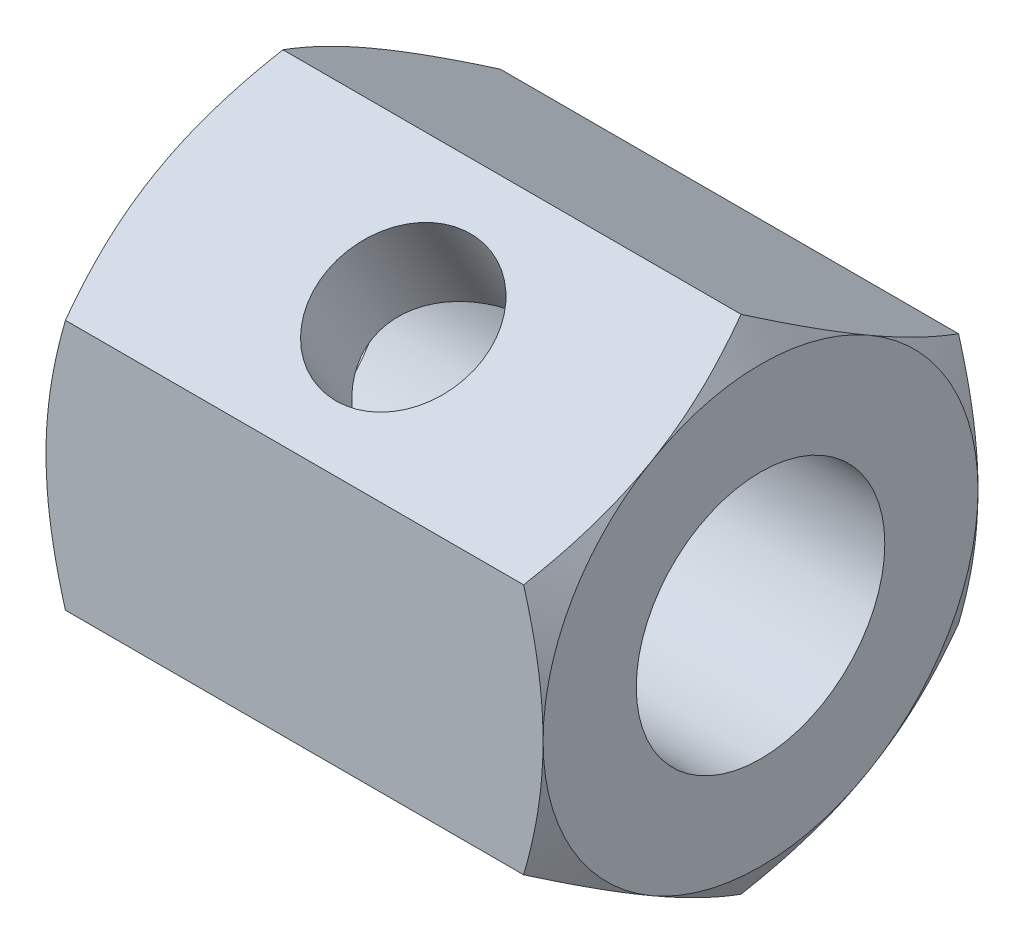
ISO-10303-21;
HEADER;
FILE_DESCRIPTION(('STEP AP214'),'2;1');
FILE_NAME('part.step','',(''),(''),'','','');
FILE_SCHEMA(('AUTOMOTIVE_DESIGN { 1 0 10303 214 1 1 1 1 }'));
ENDSEC;
DATA;
#1=APPLICATION_CONTEXT('core data for automotive mechanical design processes');
#2=APPLICATION_PROTOCOL_DEFINITION('international standard','automotive_design',2000,#1);
#3=PRODUCT_CONTEXT('',#1,'mechanical');
#4=PRODUCT('Part','Part','',(#3));
#5=PRODUCT_RELATED_PRODUCT_CATEGORY('part','',(#4));
#6=PRODUCT_DEFINITION_FORMATION('','',#4);
#7=PRODUCT_DEFINITION_CONTEXT('part definition',#1,'design');
#8=PRODUCT_DEFINITION('design','',#6,#7);
#9=PRODUCT_DEFINITION_SHAPE('','',#8);
#10=(LENGTH_UNIT() NAMED_UNIT(*) SI_UNIT(.MILLI.,.METRE.));
#11=(NAMED_UNIT(*) PLANE_ANGLE_UNIT() SI_UNIT($,.RADIAN.));
#12=(NAMED_UNIT(*) SI_UNIT($,.STERADIAN.) SOLID_ANGLE_UNIT());
#13=UNCERTAINTY_MEASURE_WITH_UNIT(LENGTH_MEASURE(1.E-05),#10,'distance_accuracy_value','');
#14=(GEOMETRIC_REPRESENTATION_CONTEXT(3) GLOBAL_UNCERTAINTY_ASSIGNED_CONTEXT((#13)) GLOBAL_UNIT_ASSIGNED_CONTEXT((#10,
#11,#12)) REPRESENTATION_CONTEXT('',''));
#15=CARTESIAN_POINT('',(0.,0.,0.));
#16=DIRECTION('',(0.,0.,1.));
#17=DIRECTION('',(1.,0.,0.));
#18=AXIS2_PLACEMENT_3D('',#15,#16,#17);
#19=CARTESIAN_POINT('',(4.,4.04145188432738,0.));
#20=DIRECTION('',(0.,-0.866025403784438,-0.500000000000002));
#21=DIRECTION('',(0.,0.500000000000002,-0.866025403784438));
#22=AXIS2_PLACEMENT_3D('',#19,#20,#21);
#23=PLANE('',#22);
#24=DIRECTION('',(-1.,0.,0.));
#25=VECTOR('',#24,1.);
#26=CARTESIAN_POINT('',(4.,4.04145188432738,0.));
#27=LINE('',#26,#25);
#28=CARTESIAN_POINT('',(3.68739260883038,4.04145188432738,0.));
#29=VERTEX_POINT('',#28);
#30=CARTESIAN_POINT('',(-3.68739260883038,4.04145188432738,0.));
#31=VERTEX_POINT('',#30);
#32=EDGE_CURVE('E261',#29,#31,#27,.T.);
#33=ORIENTED_EDGE('',*,*,#32,.T.);
#34=CARTESIAN_POINT('',(-3.68732593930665,4.04156735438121,-0.000199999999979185));
#35=CARTESIAN_POINT('',(-3.73861421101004,3.9527667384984,0.15360717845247));
#36=CARTESIAN_POINT('',(-3.78525904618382,3.86319960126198,0.308742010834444));
#37=CARTESIAN_POINT('',(-3.86667812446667,3.68251437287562,0.621698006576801));
#38=CARTESIAN_POINT('',(-3.90142356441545,3.59139307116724,0.779524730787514));
#39=CARTESIAN_POINT('',(-3.95550997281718,3.41027974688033,1.09322221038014));
#40=CARTESIAN_POINT('',(-3.97521091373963,3.32031559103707,1.24904469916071));
#41=CARTESIAN_POINT('',(-3.99872986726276,3.13996396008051,1.56142288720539));
#42=CARTESIAN_POINT('',(-4.00256735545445,3.04957714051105,1.71797745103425));
#43=CARTESIAN_POINT('',(-3.99458469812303,2.88068384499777,2.01050921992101));
#44=CARTESIAN_POINT('',(-3.9847245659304,2.80215208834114,2.14653021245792));
#45=CARTESIAN_POINT('',(-3.95347353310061,2.64560020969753,2.41768602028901));
#46=CARTESIAN_POINT('',(-3.93207195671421,2.56758062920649,2.5528198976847));
#47=CARTESIAN_POINT('',(-3.87856959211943,2.41070596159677,2.8245347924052));
#48=CARTESIAN_POINT('',(-3.84624200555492,2.33187072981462,2.96108141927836));
#49=CARTESIAN_POINT('',(-3.77287106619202,2.17537608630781,3.23213809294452));
#50=CARTESIAN_POINT('',(-3.73184495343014,2.09771466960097,3.36665161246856));
#51=CARTESIAN_POINT('',(-3.68732593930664,2.02061047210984,3.50020000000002));
#52=B_SPLINE_CURVE_WITH_KNOTS('',3,(#34,#35,#36,#37,#38,#39,#40,#41,#42,#43,#44,#45,#46,#47,#48,
#49,#50,#51),.UNSPECIFIED.,.F.,.F.,(4,2,2,2,2,2,2,2,4),(0.,0.554793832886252,1.11092123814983,
1.65328467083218,2.19498204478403,2.6666513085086,3.13875761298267,3.6213361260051,
4.10296698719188),.UNSPECIFIED.);
#53=CARTESIAN_POINT('',(-4.,3.03108891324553,1.75000000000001));
#54=VERTEX_POINT('',#53);
#55=EDGE_CURVE('E211',#31,#54,#52,.T.);
#56=ORIENTED_EDGE('',*,*,#55,.T.);
#57=CARTESIAN_POINT('',(-3.68739260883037,2.02072594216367,3.50000000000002));
#58=VERTEX_POINT('',#57);
#59=EDGE_CURVE('E131',#54,#58,#52,.T.);
#60=ORIENTED_EDGE('',*,*,#59,.T.);
#61=DIRECTION('',(-1.,0.,0.));
#62=VECTOR('',#61,1.);
#63=CARTESIAN_POINT('',(4.,2.02072594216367,3.50000000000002));
#64=LINE('',#63,#62);
#65=CARTESIAN_POINT('',(3.68739260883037,2.02072594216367,3.50000000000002));
#66=VERTEX_POINT('',#65);
#67=EDGE_CURVE('E155',#66,#58,#64,.T.);
#68=ORIENTED_EDGE('',*,*,#67,.F.);
#69=CARTESIAN_POINT('',(3.68732593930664,2.02061047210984,3.50020000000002));
#70=CARTESIAN_POINT('',(3.73861421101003,2.10941108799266,3.34639282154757));
#71=CARTESIAN_POINT('',(3.78525904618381,2.19897822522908,3.1912579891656));
#72=CARTESIAN_POINT('',(3.86667812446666,2.37966345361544,2.87830199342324));
#73=CARTESIAN_POINT('',(3.90142356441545,2.47078475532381,2.72047526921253));
#74=CARTESIAN_POINT('',(3.95550997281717,2.65189807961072,2.4067777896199));
#75=CARTESIAN_POINT('',(3.97521091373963,2.74186223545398,2.25095530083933));
#76=CARTESIAN_POINT('',(3.99872986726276,2.92221386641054,1.93857711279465));
#77=CARTESIAN_POINT('',(4.00256735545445,3.01260068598,1.78202254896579));
#78=CARTESIAN_POINT('',(3.99458469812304,3.18149398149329,1.48949078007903));
#79=CARTESIAN_POINT('',(3.98472456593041,3.26002573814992,1.35346978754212));
#80=CARTESIAN_POINT('',(3.95347353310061,3.41657761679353,1.08231397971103));
#81=CARTESIAN_POINT('',(3.93207195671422,3.49459719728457,0.94718010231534));
#82=CARTESIAN_POINT('',(3.87856959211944,3.65147186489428,0.675465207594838));
#83=CARTESIAN_POINT('',(3.84624200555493,3.73030709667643,0.538918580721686));
#84=CARTESIAN_POINT('',(3.77287106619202,3.88680174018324,0.267861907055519));
#85=CARTESIAN_POINT('',(3.73184495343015,3.96446315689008,0.133348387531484));
#86=CARTESIAN_POINT('',(3.68732593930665,4.04156735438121,-0.000199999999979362));
#87=B_SPLINE_CURVE_WITH_KNOTS('',3,(#69,#70,#71,#72,#73,#74,#75,#76,#77,#78,#79,#80,#81,#82,#83,
#84,#85,#86),.UNSPECIFIED.,.F.,.F.,(4,2,2,2,2,2,2,2,4),(0.,0.554793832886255,1.11092123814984,
1.65328467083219,2.19498204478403,2.6666513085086,3.13875761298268,3.6213361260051,
4.10296698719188),.UNSPECIFIED.);
#88=CARTESIAN_POINT('',(4.,3.03108891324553,1.75000000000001));
#89=VERTEX_POINT('',#88);
#90=EDGE_CURVE('E231',#66,#89,#87,.T.);
#91=ORIENTED_EDGE('',*,*,#90,.T.);
#92=EDGE_CURVE('E224',#89,#29,#87,.T.);
#93=ORIENTED_EDGE('',*,*,#92,.T.);
#94=EDGE_LOOP('',(#33,#56,#60,#68,#91,#93));
#95=FACE_BOUND('',#94,.T.);
#96=CARTESIAN_POINT('',(0.,3.03108891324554,1.75000000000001));
#97=DIRECTION('',(0.,0.866025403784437,0.500000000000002));
#98=DIRECTION('',(0.,-0.500000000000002,0.866025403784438));
#99=AXIS2_PLACEMENT_3D('',#96,#97,#98);
#100=CIRCLE('',#99,1.24999999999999);
#101=CARTESIAN_POINT('',(0.,2.40608891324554,2.83253175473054));
#102=VERTEX_POINT('',#101);
#103=EDGE_CURVE('E164',#102,#102,#100,.T.);
#104=ORIENTED_EDGE('',*,*,#103,.F.);
#105=EDGE_LOOP('',(#104));
#106=FACE_BOUND('',#105,.T.);
#107=ADVANCED_FACE('F31',(#95,#106),#23,.F.);
#108=CARTESIAN_POINT('',(4.,4.04145188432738,0.));
#109=DIRECTION('',(1.,0.,0.));
#110=DIRECTION('',(0.,0.,-1.));
#111=AXIS2_PLACEMENT_3D('',#108,#109,#110);
#112=PLANE('',#111);
#113=CARTESIAN_POINT('',(4.,0.,0.));
#114=DIRECTION('',(-1.,0.,0.));
#115=DIRECTION('',(0.,0.,1.));
#116=AXIS2_PLACEMENT_3D('',#113,#114,#115);
#117=CIRCLE('',#116,3.50000000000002);
#118=CARTESIAN_POINT('',(4.,0.,-3.49999999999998));
#119=VERTEX_POINT('',#118);
#120=CARTESIAN_POINT('',(4.,-3.03108891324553,-1.74999999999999));
#121=VERTEX_POINT('',#120);
#122=EDGE_CURVE('E348',#119,#121,#117,.T.);
#123=ORIENTED_EDGE('',*,*,#122,.F.);
#124=CARTESIAN_POINT('',(4.,3.03108891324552,-1.75));
#125=VERTEX_POINT('',#124);
#126=EDGE_CURVE('E345',#125,#119,#117,.T.);
#127=ORIENTED_EDGE('',*,*,#126,.F.);
#128=EDGE_CURVE('E337',#89,#125,#117,.T.);
#129=ORIENTED_EDGE('',*,*,#128,.F.);
#130=CARTESIAN_POINT('',(4.,0.,3.50000000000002));
#131=VERTEX_POINT('',#130);
#132=EDGE_CURVE('E331',#131,#89,#117,.T.);
#133=ORIENTED_EDGE('',*,*,#132,.F.);
#134=CARTESIAN_POINT('',(4.,-3.03108891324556,1.75000000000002));
#135=VERTEX_POINT('',#134);
#136=EDGE_CURVE('E334',#135,#131,#117,.T.);
#137=ORIENTED_EDGE('',*,*,#136,.F.);
#138=EDGE_CURVE('E346',#121,#135,#117,.T.);
#139=ORIENTED_EDGE('',*,*,#138,.F.);
#140=EDGE_LOOP('',(#123,#127,#129,#133,#137,#139));
#141=FACE_BOUND('',#140,.T.);
#142=CARTESIAN_POINT('',(4.,0.,0.));
#143=DIRECTION('',(1.,0.,0.));
#144=DIRECTION('',(0.,0.,-1.));
#145=AXIS2_PLACEMENT_3D('',#142,#143,#144);
#146=CIRCLE('',#145,2.);
#147=CARTESIAN_POINT('',(4.,0.,-2.));
#148=VERTEX_POINT('',#147);
#149=EDGE_CURVE('E244',#148,#148,#146,.T.);
#150=ORIENTED_EDGE('',*,*,#149,.F.);
#151=EDGE_LOOP('',(#150));
#152=FACE_BOUND('',#151,.T.);
#153=ADVANCED_FACE('F219',(#141,#152),#112,.T.);
#154=CARTESIAN_POINT('',(-4.,4.04145188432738,0.));
#155=DIRECTION('',(1.,0.,0.));
#156=DIRECTION('',(0.,0.,-1.));
#157=AXIS2_PLACEMENT_3D('',#154,#155,#156);
#158=PLANE('',#157);
#159=CARTESIAN_POINT('',(-4.,0.,0.));
#160=DIRECTION('',(-1.,0.,0.));
#161=DIRECTION('',(0.,0.,1.));
#162=AXIS2_PLACEMENT_3D('',#159,#160,#161);
#163=CIRCLE('',#162,3.50000000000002);
#164=CARTESIAN_POINT('',(-4.,3.03108891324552,-1.75));
#165=VERTEX_POINT('',#164);
#166=CARTESIAN_POINT('',(-4.,0.,-3.49999999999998));
#167=VERTEX_POINT('',#166);
#168=EDGE_CURVE('E52',#165,#167,#163,.T.);
#169=ORIENTED_EDGE('',*,*,#168,.T.);
#170=CARTESIAN_POINT('',(-4.,-3.03108891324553,-1.74999999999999));
#171=VERTEX_POINT('',#170);
#172=EDGE_CURVE('E162',#167,#171,#163,.T.);
#173=ORIENTED_EDGE('',*,*,#172,.T.);
#174=CARTESIAN_POINT('',(-4.,-3.03108891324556,1.75000000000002));
#175=VERTEX_POINT('',#174);
#176=EDGE_CURVE('E160',#171,#175,#163,.T.);
#177=ORIENTED_EDGE('',*,*,#176,.T.);
#178=CARTESIAN_POINT('',(-4.,0.,3.50000000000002));
#179=VERTEX_POINT('',#178);
#180=EDGE_CURVE('E139',#175,#179,#163,.T.);
#181=ORIENTED_EDGE('',*,*,#180,.T.);
#182=EDGE_CURVE('E125',#179,#54,#163,.T.);
#183=ORIENTED_EDGE('',*,*,#182,.T.);
#184=EDGE_CURVE('E137',#54,#165,#163,.T.);
#185=ORIENTED_EDGE('',*,*,#184,.T.);
#186=EDGE_LOOP('',(#169,#173,#177,#181,#183,#185));
#187=FACE_BOUND('',#186,.T.);
#188=CARTESIAN_POINT('',(-4.,0.,0.));
#189=DIRECTION('',(1.,0.,0.));
#190=DIRECTION('',(0.,0.,-1.));
#191=AXIS2_PLACEMENT_3D('',#188,#189,#190);
#192=CIRCLE('',#191,2.);
#193=CARTESIAN_POINT('',(-4.,0.,-2.));
#194=VERTEX_POINT('',#193);
#195=EDGE_CURVE('E248',#194,#194,#192,.T.);
#196=ORIENTED_EDGE('',*,*,#195,.T.);
#197=EDGE_LOOP('',(#196));
#198=FACE_BOUND('',#197,.T.);
#199=ADVANCED_FACE('F157',(#187,#198),#158,.F.);
#200=CARTESIAN_POINT('',(4.,2.02072594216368,-3.49999999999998));
#201=DIRECTION('',(0.,-0.866025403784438,0.500000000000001));
#202=DIRECTION('',(0.,-0.500000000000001,-0.866025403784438));
#203=AXIS2_PLACEMENT_3D('',#200,#201,#202);
#204=PLANE('',#203);
#205=DIRECTION('',(-1.,0.,0.));
#206=VECTOR('',#205,1.);
#207=CARTESIAN_POINT('',(4.,2.02072594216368,-3.49999999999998));
#208=LINE('',#207,#206);
#209=CARTESIAN_POINT('',(3.68739260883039,2.02072594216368,-3.49999999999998));
#210=VERTEX_POINT('',#209);
#211=CARTESIAN_POINT('',(-3.68739260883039,2.02072594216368,-3.49999999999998));
#212=VERTEX_POINT('',#211);
#213=EDGE_CURVE('E247',#210,#212,#208,.T.);
#214=ORIENTED_EDGE('',*,*,#213,.T.);
#215=CARTESIAN_POINT('',(-3.68732593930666,2.02061047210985,-3.50019999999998));
#216=CARTESIAN_POINT('',(-3.73861421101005,2.10941108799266,-3.34639282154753));
#217=CARTESIAN_POINT('',(-3.78525904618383,2.19897822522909,-3.19125798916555));
#218=CARTESIAN_POINT('',(-3.86667812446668,2.37966345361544,-2.8783019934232));
#219=CARTESIAN_POINT('',(-3.90142356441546,2.47078475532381,-2.72047526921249));
#220=CARTESIAN_POINT('',(-3.95550997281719,2.65189807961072,-2.40677778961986));
#221=CARTESIAN_POINT('',(-3.97521091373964,2.74186223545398,-2.25095530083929));
#222=CARTESIAN_POINT('',(-3.99872986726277,2.92221386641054,-1.93857711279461));
#223=CARTESIAN_POINT('',(-4.00256735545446,3.01260068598,-1.78202254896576));
#224=CARTESIAN_POINT('',(-3.99458469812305,3.18149398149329,-1.489490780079));
#225=CARTESIAN_POINT('',(-3.98472456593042,3.26002573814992,-1.35346978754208));
#226=CARTESIAN_POINT('',(-3.95347353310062,3.41657761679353,-1.08231397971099));
#227=CARTESIAN_POINT('',(-3.93207195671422,3.49459719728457,-0.947180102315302));
#228=CARTESIAN_POINT('',(-3.87856959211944,3.65147186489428,-0.6754652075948));
#229=CARTESIAN_POINT('',(-3.84624200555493,3.73030709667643,-0.538918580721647));
#230=CARTESIAN_POINT('',(-3.77287106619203,3.88680174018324,-0.267861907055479));
#231=CARTESIAN_POINT('',(-3.73184495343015,3.96446315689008,-0.133348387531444));
#232=CARTESIAN_POINT('',(-3.68732593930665,4.04156735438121,0.000200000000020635));
#233=B_SPLINE_CURVE_WITH_KNOTS('',3,(#215,#216,#217,#218,#219,#220,#221,#222,#223,#224,#225,
#226,#227,#228,#229,#230,#231,#232),.UNSPECIFIED.,.F.,.F.,(4,2,2,2,2,2,2,2,4),(0.,
0.554793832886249,1.11092123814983,1.65328467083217,2.19498204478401,2.66665130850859,
3.13875761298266,3.62133612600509,4.10296698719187),.UNSPECIFIED.);
#234=EDGE_CURVE('E347',#212,#165,#233,.T.);
#235=ORIENTED_EDGE('',*,*,#234,.T.);
#236=EDGE_CURVE('E212',#165,#31,#233,.T.);
#237=ORIENTED_EDGE('',*,*,#236,.T.);
#238=ORIENTED_EDGE('',*,*,#32,.F.);
#239=CARTESIAN_POINT('',(3.68732593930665,4.04156735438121,0.000200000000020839));
#240=CARTESIAN_POINT('',(3.73861421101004,3.9527667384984,-0.153607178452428));
#241=CARTESIAN_POINT('',(3.78525904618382,3.86319960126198,-0.308742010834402));
#242=CARTESIAN_POINT('',(3.86667812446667,3.68251437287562,-0.621698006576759));
#243=CARTESIAN_POINT('',(3.90142356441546,3.59139307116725,-0.779524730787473));
#244=CARTESIAN_POINT('',(3.95550997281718,3.41027974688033,-1.0932222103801));
#245=CARTESIAN_POINT('',(3.97521091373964,3.32031559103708,-1.24904469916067));
#246=CARTESIAN_POINT('',(3.99872986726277,3.13996396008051,-1.56142288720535));
#247=CARTESIAN_POINT('',(4.00256735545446,3.04957714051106,-1.71797745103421));
#248=CARTESIAN_POINT('',(3.99458469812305,2.88068384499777,-2.01050921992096));
#249=CARTESIAN_POINT('',(3.98472456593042,2.80215208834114,-2.14653021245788));
#250=CARTESIAN_POINT('',(3.95347353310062,2.64560020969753,-2.41768602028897));
#251=CARTESIAN_POINT('',(3.93207195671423,2.56758062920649,-2.55281989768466));
#252=CARTESIAN_POINT('',(3.87856959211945,2.41070596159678,-2.82453479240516));
#253=CARTESIAN_POINT('',(3.84624200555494,2.33187072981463,-2.96108141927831));
#254=CARTESIAN_POINT('',(3.77287106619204,2.17537608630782,-3.23213809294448));
#255=CARTESIAN_POINT('',(3.73184495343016,2.09771466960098,-3.36665161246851));
#256=CARTESIAN_POINT('',(3.68732593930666,2.02061047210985,-3.50019999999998));
#257=B_SPLINE_CURVE_WITH_KNOTS('',3,(#239,#240,#241,#242,#243,#244,#245,#246,#247,#248,#249,
#250,#251,#252,#253,#254,#255,#256),.UNSPECIFIED.,.F.,.F.,(4,2,2,2,2,2,2,2,4),(0.,
0.554793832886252,1.11092123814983,1.65328467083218,2.19498204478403,2.66665130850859,
3.13875761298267,3.62133612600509,4.10296698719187),.UNSPECIFIED.);
#258=EDGE_CURVE('E353',#29,#125,#257,.T.);
#259=ORIENTED_EDGE('',*,*,#258,.T.);
#260=EDGE_CURVE('E342',#125,#210,#257,.T.);
#261=ORIENTED_EDGE('',*,*,#260,.T.);
#262=EDGE_LOOP('',(#214,#235,#237,#238,#259,#261));
#263=FACE_BOUND('',#262,.T.);
#264=ADVANCED_FACE('F33',(#263),#204,.F.);
#265=CARTESIAN_POINT('',(4.,2.02072594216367,3.50000000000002));
#266=DIRECTION('',(0.,0.,-1.));
#267=DIRECTION('',(-1.,0.,0.));
#268=AXIS2_PLACEMENT_3D('',#265,#266,#267);
#269=PLANE('',#268);
#270=ORIENTED_EDGE('',*,*,#67,.T.);
#271=CARTESIAN_POINT('',(-2.24823911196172,-5.517696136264,3.50000000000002));
#272=CARTESIAN_POINT('',(-2.3231358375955,-5.3640335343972,3.50000000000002));
#273=CARTESIAN_POINT('',(-2.39733986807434,-5.21002764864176,3.50000000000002));
#274=CARTESIAN_POINT('',(-2.54397460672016,-4.90114704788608,3.50000000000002));
#275=CARTESIAN_POINT('',(-2.61640505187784,-4.74627220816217,3.50000000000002));
#276=CARTESIAN_POINT('',(-2.7594500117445,-4.43471591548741,3.50000000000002));
#277=CARTESIAN_POINT('',(-2.83005324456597,-4.27802926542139,3.50000000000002));
#278=CARTESIAN_POINT('',(-2.96848733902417,-3.96344053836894,3.50000000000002));
#279=CARTESIAN_POINT('',(-3.03631832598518,-3.80553851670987,3.50000000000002));
#280=CARTESIAN_POINT('',(-3.17072464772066,-3.48287670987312,3.50000000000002));
#281=CARTESIAN_POINT('',(-3.23717895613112,-3.31806624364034,3.50000000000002));
#282=CARTESIAN_POINT('',(-3.36527197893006,-2.9865506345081,3.50000000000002));
#283=CARTESIAN_POINT('',(-3.42691016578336,-2.81984528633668,3.50000000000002));
#284=CARTESIAN_POINT('',(-3.54381855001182,-2.48455858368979,3.50000000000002));
#285=CARTESIAN_POINT('',(-3.5991008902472,-2.31598150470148,3.50000000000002));
#286=CARTESIAN_POINT('',(-3.70158342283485,-1.9764107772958,3.50000000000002));
#287=CARTESIAN_POINT('',(-3.74878606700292,-1.80541787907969,3.50000000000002));
#288=CARTESIAN_POINT('',(-3.83265303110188,-1.46186590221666,3.50000000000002));
#289=CARTESIAN_POINT('',(-3.86937653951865,-1.28932153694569,3.50000000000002));
#290=CARTESIAN_POINT('',(-3.93026837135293,-0.941996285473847,3.50000000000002));
#291=CARTESIAN_POINT('',(-3.95443806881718,-0.767215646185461,3.50000000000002));
#292=CARTESIAN_POINT('',(-3.98798243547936,-0.418609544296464,3.50000000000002));
#293=CARTESIAN_POINT('',(-3.99755428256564,-0.244803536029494,3.50000000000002));
#294=CARTESIAN_POINT('',(-4.00161659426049,0.103003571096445,3.50000000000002));
#295=CARTESIAN_POINT('',(-3.9961068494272,0.27700467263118,3.50000000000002));
#296=CARTESIAN_POINT('',(-3.97454594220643,0.569771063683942,3.50000000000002));
#297=CARTESIAN_POINT('',(-3.96231865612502,0.688837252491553,3.50000000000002));
#298=CARTESIAN_POINT('',(-3.9315159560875,0.926151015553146,3.50000000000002));
#299=CARTESIAN_POINT('',(-3.91293975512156,1.04439848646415,3.50000000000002));
#300=CARTESIAN_POINT('',(-3.84865875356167,1.3977224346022,3.50000000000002));
#301=CARTESIAN_POINT('',(-3.794411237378,1.63126494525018,3.50000000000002));
#302=CARTESIAN_POINT('',(-3.6996529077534,1.98067249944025,3.50000000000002));
#303=CARTESIAN_POINT('',(-3.66536401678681,2.09832851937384,3.50000000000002));
#304=CARTESIAN_POINT('',(-3.59305415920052,2.33249920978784,3.50000000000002));
#305=CARTESIAN_POINT('',(-3.5550331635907,2.4490138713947,3.50000000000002));
#306=CARTESIAN_POINT('',(-3.4758833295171,2.68093688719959,3.50000000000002));
#307=CARTESIAN_POINT('',(-3.43475535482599,2.79634553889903,3.50000000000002));
#308=CARTESIAN_POINT('',(-3.34989244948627,3.02619406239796,3.50000000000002));
#309=CARTESIAN_POINT('',(-3.30615758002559,3.14063395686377,3.50000000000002));
#310=CARTESIAN_POINT('',(-3.18443760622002,3.45024220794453,3.50000000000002));
#311=CARTESIAN_POINT('',(-3.10433839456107,3.64457866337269,3.50000000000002));
#312=CARTESIAN_POINT('',(-2.93938953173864,4.03123256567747,3.50000000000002));
#313=CARTESIAN_POINT('',(-2.85453933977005,4.22354977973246,3.50000000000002));
#314=CARTESIAN_POINT('',(-2.6812230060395,4.6066251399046,3.50000000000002));
#315=CARTESIAN_POINT('',(-2.59275558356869,4.7973827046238,3.50000000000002));
#316=CARTESIAN_POINT('',(-2.41306651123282,5.1775989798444,3.50000000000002));
#317=CARTESIAN_POINT('',(-2.32184477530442,5.3670576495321,3.50000000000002));
#318=CARTESIAN_POINT('',(-2.13710830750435,5.74522673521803,3.50000000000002));
#319=CARTESIAN_POINT('',(-2.04359014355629,5.93393547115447,3.50000000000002));
#320=CARTESIAN_POINT('',(-1.85484549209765,6.31049758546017,3.50000000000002));
#321=CARTESIAN_POINT('',(-1.75961898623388,6.49835095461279,3.50000000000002));
#322=CARTESIAN_POINT('',(-1.47194584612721,7.06078180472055,3.50000000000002));
#323=CARTESIAN_POINT('',(-1.27746262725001,7.43431711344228,3.50000000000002));
#324=CARTESIAN_POINT('',(-0.905848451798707,8.13967176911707,3.50000000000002));
#325=CARTESIAN_POINT('',(-0.729083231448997,8.47168474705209,3.50000000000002));
#326=CARTESIAN_POINT('',(-0.373429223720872,9.13459786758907,3.50000000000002));
#327=CARTESIAN_POINT('',(-0.194540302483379,9.46549793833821,3.50000000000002));
#328=CARTESIAN_POINT('',(0.164195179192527,10.1253176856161,3.50000000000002));
#329=CARTESIAN_POINT('',(0.344036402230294,10.4542402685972,3.50000000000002));
#330=CARTESIAN_POINT('',(0.704921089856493,11.1113910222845,3.50000000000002));
#331=CARTESIAN_POINT('',(0.885964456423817,11.4396192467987,3.50000000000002));
#332=CARTESIAN_POINT('',(1.06744506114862,11.7676040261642,3.50000000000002));
#333=B_SPLINE_CURVE_WITH_KNOTS('',3,(#271,#272,#273,#274,#275,#276,#277,#278,#279,#280,#281,
#282,#283,#284,#285,#286,#287,#288,#289,#290,#291,#292,#293,#294,#295,#296,#297,#298,#299,#300,
#301,#302,#303,#304,#305,#306,#307,#308,#309,#310,#311,#312,#313,#314,#315,#316,#317,#318,#319,
#320,#321,#322,#323,#324,#325,#326,#327,#328,#329,#330,#331,#332),.UNSPECIFIED.,.F.,.F.,(4,2,2,
2,2,2,2,2,2,2,2,2,2,2,2,2,2,2,2,2,2,2,2,2,2,2,2,2,2,2,4),(0.,0.512836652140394,1.02574889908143,
1.54130440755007,2.05683658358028,2.58988996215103,3.1230016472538,3.6550772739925,
4.18699115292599,4.71583834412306,5.24462763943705,5.76620909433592,6.28779779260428,
6.64670255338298,7.00565182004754,7.72389648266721,8.09151480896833,8.45913599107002,
8.82665534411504,9.19416607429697,9.82466050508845,10.4552268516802,11.0860184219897,
11.7168297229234,12.3486493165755,12.9804757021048,14.2438371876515,15.3722384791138,
16.5007112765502,17.6253402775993,18.7498786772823),.UNSPECIFIED.);
#334=EDGE_CURVE('E129',#58,#179,#333,.F.);
#335=ORIENTED_EDGE('',*,*,#334,.T.);
#336=CARTESIAN_POINT('',(-3.68739260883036,-2.02072594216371,3.50000000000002));
#337=VERTEX_POINT('',#336);
#338=EDGE_CURVE('E142',#179,#337,#333,.F.);
#339=ORIENTED_EDGE('',*,*,#338,.T.);
#340=DIRECTION('',(-1.,0.,0.));
#341=VECTOR('',#340,1.);
#342=CARTESIAN_POINT('',(4.,-2.02072594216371,3.50000000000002));
#343=LINE('',#342,#341);
#344=CARTESIAN_POINT('',(3.68739260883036,-2.02072594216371,3.50000000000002));
#345=VERTEX_POINT('',#344);
#346=EDGE_CURVE('E258',#345,#337,#343,.T.);
#347=ORIENTED_EDGE('',*,*,#346,.F.);
#348=CARTESIAN_POINT('',(2.24823911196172,-5.517696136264,3.50000000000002));
#349=CARTESIAN_POINT('',(2.3231358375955,-5.3640335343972,3.50000000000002));
#350=CARTESIAN_POINT('',(2.39733986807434,-5.21002764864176,3.50000000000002));
#351=CARTESIAN_POINT('',(2.54397460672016,-4.90114704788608,3.50000000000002));
#352=CARTESIAN_POINT('',(2.61640505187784,-4.74627220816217,3.50000000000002));
#353=CARTESIAN_POINT('',(2.7594500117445,-4.43471591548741,3.50000000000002));
#354=CARTESIAN_POINT('',(2.83005324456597,-4.27802926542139,3.50000000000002));
#355=CARTESIAN_POINT('',(2.96848733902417,-3.96344053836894,3.50000000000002));
#356=CARTESIAN_POINT('',(3.03631832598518,-3.80553851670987,3.50000000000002));
#357=CARTESIAN_POINT('',(3.17072464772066,-3.48287670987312,3.50000000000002));
#358=CARTESIAN_POINT('',(3.23717895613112,-3.31806624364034,3.50000000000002));
#359=CARTESIAN_POINT('',(3.36527197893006,-2.9865506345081,3.50000000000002));
#360=CARTESIAN_POINT('',(3.42691016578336,-2.81984528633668,3.50000000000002));
#361=CARTESIAN_POINT('',(3.54381855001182,-2.48455858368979,3.50000000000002));
#362=CARTESIAN_POINT('',(3.5991008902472,-2.31598150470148,3.50000000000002));
#363=CARTESIAN_POINT('',(3.70158342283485,-1.9764107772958,3.50000000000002));
#364=CARTESIAN_POINT('',(3.74878606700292,-1.80541787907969,3.50000000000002));
#365=CARTESIAN_POINT('',(3.83265303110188,-1.46186590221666,3.50000000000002));
#366=CARTESIAN_POINT('',(3.86937653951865,-1.28932153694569,3.50000000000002));
#367=CARTESIAN_POINT('',(3.93026837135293,-0.941996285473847,3.50000000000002));
#368=CARTESIAN_POINT('',(3.95443806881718,-0.767215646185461,3.50000000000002));
#369=CARTESIAN_POINT('',(3.98798243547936,-0.418609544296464,3.50000000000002));
#370=CARTESIAN_POINT('',(3.99755428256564,-0.244803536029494,3.50000000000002));
#371=CARTESIAN_POINT('',(4.00161659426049,0.103003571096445,3.50000000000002));
#372=CARTESIAN_POINT('',(3.9961068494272,0.27700467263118,3.50000000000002));
#373=CARTESIAN_POINT('',(3.97454594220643,0.569771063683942,3.50000000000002));
#374=CARTESIAN_POINT('',(3.96231865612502,0.688837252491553,3.50000000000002));
#375=CARTESIAN_POINT('',(3.9315159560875,0.926151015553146,3.50000000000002));
#376=CARTESIAN_POINT('',(3.91293975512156,1.04439848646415,3.50000000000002));
#377=CARTESIAN_POINT('',(3.84865875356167,1.3977224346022,3.50000000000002));
#378=CARTESIAN_POINT('',(3.794411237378,1.63126494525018,3.50000000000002));
#379=CARTESIAN_POINT('',(3.6996529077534,1.98067249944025,3.50000000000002));
#380=CARTESIAN_POINT('',(3.66536401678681,2.09832851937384,3.50000000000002));
#381=CARTESIAN_POINT('',(3.59305415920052,2.33249920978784,3.50000000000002));
#382=CARTESIAN_POINT('',(3.5550331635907,2.4490138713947,3.50000000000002));
#383=CARTESIAN_POINT('',(3.4758833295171,2.68093688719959,3.50000000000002));
#384=CARTESIAN_POINT('',(3.43475535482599,2.79634553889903,3.50000000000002));
#385=CARTESIAN_POINT('',(3.34989244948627,3.02619406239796,3.50000000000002));
#386=CARTESIAN_POINT('',(3.30615758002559,3.14063395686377,3.50000000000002));
#387=CARTESIAN_POINT('',(3.18443760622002,3.45024220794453,3.50000000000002));
#388=CARTESIAN_POINT('',(3.10433839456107,3.64457866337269,3.50000000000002));
#389=CARTESIAN_POINT('',(2.93938953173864,4.03123256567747,3.50000000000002));
#390=CARTESIAN_POINT('',(2.85453933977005,4.22354977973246,3.50000000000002));
#391=CARTESIAN_POINT('',(2.6812230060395,4.6066251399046,3.50000000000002));
#392=CARTESIAN_POINT('',(2.59275558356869,4.7973827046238,3.50000000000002));
#393=CARTESIAN_POINT('',(2.41306651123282,5.1775989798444,3.50000000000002));
#394=CARTESIAN_POINT('',(2.32184477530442,5.3670576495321,3.50000000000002));
#395=CARTESIAN_POINT('',(2.13710830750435,5.74522673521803,3.50000000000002));
#396=CARTESIAN_POINT('',(2.04359014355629,5.93393547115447,3.50000000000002));
#397=CARTESIAN_POINT('',(1.85484549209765,6.31049758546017,3.50000000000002));
#398=CARTESIAN_POINT('',(1.75961898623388,6.49835095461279,3.50000000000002));
#399=CARTESIAN_POINT('',(1.47194584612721,7.06078180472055,3.50000000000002));
#400=CARTESIAN_POINT('',(1.27746262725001,7.43431711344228,3.50000000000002));
#401=CARTESIAN_POINT('',(0.905848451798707,8.13967176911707,3.50000000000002));
#402=CARTESIAN_POINT('',(0.729083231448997,8.47168474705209,3.50000000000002));
#403=CARTESIAN_POINT('',(0.373429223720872,9.13459786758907,3.50000000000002));
#404=CARTESIAN_POINT('',(0.194540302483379,9.46549793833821,3.50000000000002));
#405=CARTESIAN_POINT('',(-0.164195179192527,10.1253176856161,3.50000000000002));
#406=CARTESIAN_POINT('',(-0.344036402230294,10.4542402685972,3.50000000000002));
#407=CARTESIAN_POINT('',(-0.704921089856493,11.1113910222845,3.50000000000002));
#408=CARTESIAN_POINT('',(-0.885964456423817,11.4396192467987,3.50000000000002));
#409=CARTESIAN_POINT('',(-1.06744506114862,11.7676040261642,3.50000000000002));
#410=B_SPLINE_CURVE_WITH_KNOTS('',3,(#348,#349,#350,#351,#352,#353,#354,#355,#356,#357,#358,
#359,#360,#361,#362,#363,#364,#365,#366,#367,#368,#369,#370,#371,#372,#373,#374,#375,#376,#377,
#378,#379,#380,#381,#382,#383,#384,#385,#386,#387,#388,#389,#390,#391,#392,#393,#394,#395,#396,
#397,#398,#399,#400,#401,#402,#403,#404,#405,#406,#407,#408,#409),.UNSPECIFIED.,.F.,.F.,(4,2,2,
2,2,2,2,2,2,2,2,2,2,2,2,2,2,2,2,2,2,2,2,2,2,2,2,2,2,2,4),(0.,0.512836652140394,1.02574889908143,
1.54130440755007,2.05683658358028,2.58988996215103,3.1230016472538,3.6550772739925,
4.18699115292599,4.71583834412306,5.24462763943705,5.76620909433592,6.28779779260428,
6.64670255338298,7.00565182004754,7.72389648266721,8.09151480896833,8.45913599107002,
8.82665534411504,9.19416607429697,9.82466050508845,10.4552268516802,11.0860184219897,
11.7168297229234,12.3486493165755,12.9804757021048,14.2438371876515,15.3722384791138,
16.5007112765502,17.6253402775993,18.7498786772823),.UNSPECIFIED.);
#411=EDGE_CURVE('E242',#345,#131,#410,.T.);
#412=ORIENTED_EDGE('',*,*,#411,.T.);
#413=EDGE_CURVE('E237',#131,#66,#410,.T.);
#414=ORIENTED_EDGE('',*,*,#413,.T.);
#415=EDGE_LOOP('',(#270,#335,#339,#347,#412,#414));
#416=FACE_BOUND('',#415,.T.);
#417=ADVANCED_FACE('F152',(#416),#269,.F.);
#418=CARTESIAN_POINT('',(4.,-2.02072594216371,3.50000000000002));
#419=DIRECTION('',(0.,0.866025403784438,-0.500000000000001));
#420=DIRECTION('',(0.,0.500000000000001,0.866025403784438));
#421=AXIS2_PLACEMENT_3D('',#418,#419,#420);
#422=PLANE('',#421);
#423=ORIENTED_EDGE('',*,*,#346,.T.);
#424=CARTESIAN_POINT('',(-3.68732593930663,-2.02061047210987,3.50020000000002));
#425=CARTESIAN_POINT('',(-3.73861421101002,-2.10941108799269,3.34639282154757));
#426=CARTESIAN_POINT('',(-3.7852590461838,-2.19897822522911,3.1912579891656));
#427=CARTESIAN_POINT('',(-3.86667812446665,-2.37966345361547,2.87830199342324));
#428=CARTESIAN_POINT('',(-3.90142356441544,-2.47078475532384,2.72047526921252));
#429=CARTESIAN_POINT('',(-3.95550997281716,-2.65189807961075,2.40677778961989));
#430=CARTESIAN_POINT('',(-3.97521091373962,-2.74186223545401,2.25095530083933));
#431=CARTESIAN_POINT('',(-3.99872986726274,-2.92221386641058,1.93857711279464));
#432=CARTESIAN_POINT('',(-4.00256735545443,-3.01260068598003,1.78202254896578));
#433=CARTESIAN_POINT('',(-3.99458469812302,-3.18149398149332,1.48949078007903));
#434=CARTESIAN_POINT('',(-3.98472456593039,-3.26002573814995,1.35346978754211));
#435=CARTESIAN_POINT('',(-3.9534735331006,-3.41657761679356,1.08231397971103));
#436=CARTESIAN_POINT('',(-3.9320719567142,-3.49459719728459,0.947180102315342));
#437=CARTESIAN_POINT('',(-3.87856959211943,-3.6514718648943,0.675465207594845));
#438=CARTESIAN_POINT('',(-3.84624200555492,-3.73030709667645,0.538918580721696));
#439=CARTESIAN_POINT('',(-3.77287106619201,-3.88680174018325,0.267861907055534));
#440=CARTESIAN_POINT('',(-3.73184495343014,-3.9644631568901,0.133348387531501));
#441=CARTESIAN_POINT('',(-3.68732593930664,-4.04156735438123,-0.000199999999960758));
#442=B_SPLINE_CURVE_WITH_KNOTS('',3,(#424,#425,#426,#427,#428,#429,#430,#431,#432,#433,#434,
#435,#436,#437,#438,#439,#440,#441),.UNSPECIFIED.,.F.,.F.,(4,2,2,2,2,2,2,2,4),(0.,
0.554793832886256,1.11092123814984,1.65328467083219,2.19498204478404,2.6666513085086,
3.13875761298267,3.62133612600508,4.10296698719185),.UNSPECIFIED.);
#443=EDGE_CURVE('E146',#337,#175,#442,.T.);
#444=ORIENTED_EDGE('',*,*,#443,.T.);
#445=CARTESIAN_POINT('',(-3.68739260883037,-4.04145188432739,0.));
#446=VERTEX_POINT('',#445);
#447=EDGE_CURVE('E179',#175,#446,#442,.T.);
#448=ORIENTED_EDGE('',*,*,#447,.T.);
#449=DIRECTION('',(-1.,0.,0.));
#450=VECTOR('',#449,1.);
#451=CARTESIAN_POINT('',(4.,-4.04145188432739,0.));
#452=LINE('',#451,#450);
#453=CARTESIAN_POINT('',(3.68739260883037,-4.04145188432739,0.));
#454=VERTEX_POINT('',#453);
#455=EDGE_CURVE('E255',#454,#446,#452,.T.);
#456=ORIENTED_EDGE('',*,*,#455,.F.);
#457=CARTESIAN_POINT('',(3.68732593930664,-4.04156735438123,-0.000199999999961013));
#458=CARTESIAN_POINT('',(3.73861421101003,-3.95276673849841,0.153607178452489));
#459=CARTESIAN_POINT('',(3.78525904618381,-3.86319960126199,0.308742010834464));
#460=CARTESIAN_POINT('',(3.86667812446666,-3.68251437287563,0.621698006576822));
#461=CARTESIAN_POINT('',(3.90142356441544,-3.59139307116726,0.779524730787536));
#462=CARTESIAN_POINT('',(3.95550997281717,-3.41027974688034,1.09322221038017));
#463=CARTESIAN_POINT('',(3.97521091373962,-3.32031559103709,1.24904469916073));
#464=CARTESIAN_POINT('',(3.99872986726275,-3.13996396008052,1.56142288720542));
#465=CARTESIAN_POINT('',(4.00256735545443,-3.04957714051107,1.71797745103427));
#466=CARTESIAN_POINT('',(3.99458469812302,-2.88068384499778,2.01050921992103));
#467=CARTESIAN_POINT('',(3.98472456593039,-2.80215208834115,2.14653021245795));
#468=CARTESIAN_POINT('',(3.95347353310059,-2.64560020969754,2.41768602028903));
#469=CARTESIAN_POINT('',(3.9320719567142,-2.56758062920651,2.55281989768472));
#470=CARTESIAN_POINT('',(3.87856959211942,-2.4107059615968,2.82453479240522));
#471=CARTESIAN_POINT('',(3.84624200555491,-2.33187072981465,2.96108141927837));
#472=CARTESIAN_POINT('',(3.77287106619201,-2.17537608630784,3.23213809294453));
#473=CARTESIAN_POINT('',(3.73184495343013,-2.097714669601,3.36665161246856));
#474=CARTESIAN_POINT('',(3.68732593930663,-2.02061047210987,3.50020000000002));
#475=B_SPLINE_CURVE_WITH_KNOTS('',3,(#457,#458,#459,#460,#461,#462,#463,#464,#465,#466,#467,
#468,#469,#470,#471,#472,#473,#474),.UNSPECIFIED.,.F.,.F.,(4,2,2,2,2,2,2,2,4),(0.,
0.554793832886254,1.11092123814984,1.65328467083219,2.19498204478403,2.6666513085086,
3.13875761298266,3.62133612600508,4.10296698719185),.UNSPECIFIED.);
#476=EDGE_CURVE('E232',#454,#135,#475,.T.);
#477=ORIENTED_EDGE('',*,*,#476,.T.);
#478=EDGE_CURVE('E243',#135,#345,#475,.T.);
#479=ORIENTED_EDGE('',*,*,#478,.T.);
#480=EDGE_LOOP('',(#423,#444,#448,#456,#477,#479));
#481=FACE_BOUND('',#480,.T.);
#482=ADVANCED_FACE('F321',(#481),#422,.F.);
#483=CARTESIAN_POINT('',(4.,-4.04145188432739,0.));
#484=DIRECTION('',(0.,0.866025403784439,0.5));
#485=DIRECTION('',(0.,-0.499999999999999,0.866025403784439));
#486=AXIS2_PLACEMENT_3D('',#483,#484,#485);
#487=PLANE('',#486);
#488=ORIENTED_EDGE('',*,*,#455,.T.);
#489=CARTESIAN_POINT('',(-3.68732593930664,-4.04156735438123,0.000200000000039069));
#490=CARTESIAN_POINT('',(-3.73861421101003,-3.95276673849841,-0.15360717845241));
#491=CARTESIAN_POINT('',(-3.78525904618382,-3.86319960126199,-0.308742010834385));
#492=CARTESIAN_POINT('',(-3.86667812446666,-3.68251437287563,-0.621698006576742));
#493=CARTESIAN_POINT('',(-3.90142356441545,-3.59139307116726,-0.779524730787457));
#494=CARTESIAN_POINT('',(-3.95550997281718,-3.41027974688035,-1.09322221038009));
#495=CARTESIAN_POINT('',(-3.97521091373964,-3.32031559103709,-1.24904469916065));
#496=CARTESIAN_POINT('',(-3.99872986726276,-3.13996396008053,-1.56142288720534));
#497=CARTESIAN_POINT('',(-4.00256735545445,-3.04957714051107,-1.71797745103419));
#498=CARTESIAN_POINT('',(-3.99458469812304,-2.88068384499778,-2.01050921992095));
#499=CARTESIAN_POINT('',(-3.98472456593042,-2.80215208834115,-2.14653021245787));
#500=CARTESIAN_POINT('',(-3.95347353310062,-2.64560020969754,-2.41768602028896));
#501=CARTESIAN_POINT('',(-3.93207195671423,-2.5675806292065,-2.55281989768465));
#502=CARTESIAN_POINT('',(-3.87856959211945,-2.41070596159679,-2.82453479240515));
#503=CARTESIAN_POINT('',(-3.84624200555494,-2.33187072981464,-2.96108141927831));
#504=CARTESIAN_POINT('',(-3.77287106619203,-2.17537608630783,-3.23213809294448));
#505=CARTESIAN_POINT('',(-3.73184495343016,-2.09771466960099,-3.36665161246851));
#506=CARTESIAN_POINT('',(-3.68732593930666,-2.02061047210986,-3.50019999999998));
#507=B_SPLINE_CURVE_WITH_KNOTS('',3,(#489,#490,#491,#492,#493,#494,#495,#496,#497,#498,#499,
#500,#501,#502,#503,#504,#505,#506),.UNSPECIFIED.,.F.,.F.,(4,2,2,2,2,2,2,2,4),(0.,
0.554793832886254,1.11092123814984,1.65328467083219,2.19498204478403,2.6666513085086,
3.13875761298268,3.62133612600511,4.10296698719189),.UNSPECIFIED.);
#508=EDGE_CURVE('E178',#446,#171,#507,.T.);
#509=ORIENTED_EDGE('',*,*,#508,.T.);
#510=CARTESIAN_POINT('',(-3.68739260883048,-2.02072594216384,-3.49999999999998));
#511=VERTEX_POINT('',#510);
#512=EDGE_CURVE('E136',#171,#511,#507,.T.);
#513=ORIENTED_EDGE('',*,*,#512,.T.);
#514=DIRECTION('',(-1.,0.,0.));
#515=VECTOR('',#514,1.);
#516=CARTESIAN_POINT('',(4.,-2.0207259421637,-3.49999999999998));
#517=LINE('',#516,#515);
#518=CARTESIAN_POINT('',(3.68739260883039,-2.0207259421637,-3.49999999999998));
#519=VERTEX_POINT('',#518);
#520=EDGE_CURVE('E253',#519,#511,#517,.T.);
#521=ORIENTED_EDGE('',*,*,#520,.F.);
#522=CARTESIAN_POINT('',(3.68732593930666,-2.02061047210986,-3.50019999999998));
#523=CARTESIAN_POINT('',(3.73861421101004,-2.10941108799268,-3.34639282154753));
#524=CARTESIAN_POINT('',(3.78525904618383,-2.1989782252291,-3.19125798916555));
#525=CARTESIAN_POINT('',(3.86667812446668,-2.37966345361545,-2.8783019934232));
#526=CARTESIAN_POINT('',(3.90142356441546,-2.47078475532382,-2.72047526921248));
#527=CARTESIAN_POINT('',(3.95550997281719,-2.65189807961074,-2.40677778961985));
#528=CARTESIAN_POINT('',(3.97521091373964,-2.74186223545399,-2.25095530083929));
#529=CARTESIAN_POINT('',(3.99872986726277,-2.92221386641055,-1.93857711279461));
#530=CARTESIAN_POINT('',(4.00256735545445,-3.01260068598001,-1.78202254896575));
#531=CARTESIAN_POINT('',(3.99458469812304,-3.1814939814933,-1.48949078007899));
#532=CARTESIAN_POINT('',(3.98472456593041,-3.26002573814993,-1.35346978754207));
#533=CARTESIAN_POINT('',(3.95347353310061,-3.41657761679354,-1.08231397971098));
#534=CARTESIAN_POINT('',(3.93207195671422,-3.49459719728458,-0.947180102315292));
#535=CARTESIAN_POINT('',(3.87856959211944,-3.65147186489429,-0.675465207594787));
#536=CARTESIAN_POINT('',(3.84624200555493,-3.73030709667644,-0.538918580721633));
#537=CARTESIAN_POINT('',(3.77287106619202,-3.88680174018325,-0.267861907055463));
#538=CARTESIAN_POINT('',(3.73184495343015,-3.9644631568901,-0.133348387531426));
#539=CARTESIAN_POINT('',(3.68732593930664,-4.04156735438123,0.000200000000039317));
#540=B_SPLINE_CURVE_WITH_KNOTS('',3,(#522,#523,#524,#525,#526,#527,#528,#529,#530,#531,#532,
#533,#534,#535,#536,#537,#538,#539),.UNSPECIFIED.,.F.,.F.,(4,2,2,2,2,2,2,2,4),(0.,
0.55479383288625,1.11092123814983,1.65328467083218,2.19498204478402,2.66665130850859,
3.13875761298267,3.6213361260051,4.10296698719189),.UNSPECIFIED.);
#541=EDGE_CURVE('E340',#519,#121,#540,.T.);
#542=ORIENTED_EDGE('',*,*,#541,.T.);
#543=EDGE_CURVE('E344',#121,#454,#540,.T.);
#544=ORIENTED_EDGE('',*,*,#543,.T.);
#545=EDGE_LOOP('',(#488,#509,#513,#521,#542,#544));
#546=FACE_BOUND('',#545,.T.);
#547=ADVANCED_FACE('F184',(#546),#487,.F.);
#548=CARTESIAN_POINT('',(4.,-2.0207259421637,-3.49999999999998));
#549=DIRECTION('',(0.,0.,1.));
#550=DIRECTION('',(1.,0.,0.));
#551=AXIS2_PLACEMENT_3D('',#548,#549,#550);
#552=PLANE('',#551);
#553=ORIENTED_EDGE('',*,*,#520,.T.);
#554=CARTESIAN_POINT('',(-2.24823911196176,-5.51769613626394,-3.49999999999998));
#555=CARTESIAN_POINT('',(-2.32313583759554,-5.36403353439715,-3.49999999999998));
#556=CARTESIAN_POINT('',(-2.39733986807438,-5.21002764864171,-3.49999999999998));
#557=CARTESIAN_POINT('',(-2.54397460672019,-4.90114704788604,-3.49999999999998));
#558=CARTESIAN_POINT('',(-2.61640505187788,-4.74627220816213,-3.49999999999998));
#559=CARTESIAN_POINT('',(-2.75945001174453,-4.43471591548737,-3.49999999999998));
#560=CARTESIAN_POINT('',(-2.830053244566,-4.27802926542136,-3.49999999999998));
#561=CARTESIAN_POINT('',(-2.9684873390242,-3.96344053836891,-3.49999999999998));
#562=CARTESIAN_POINT('',(-3.03631832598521,-3.80553851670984,-3.49999999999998));
#563=CARTESIAN_POINT('',(-3.17072464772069,-3.48287670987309,-3.49999999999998));
#564=CARTESIAN_POINT('',(-3.23717895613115,-3.31806624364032,-3.49999999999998));
#565=CARTESIAN_POINT('',(-3.36527197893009,-2.98655063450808,-3.49999999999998));
#566=CARTESIAN_POINT('',(-3.42691016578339,-2.81984528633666,-3.49999999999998));
#567=CARTESIAN_POINT('',(-3.54381855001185,-2.48455858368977,-3.49999999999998));
#568=CARTESIAN_POINT('',(-3.59910089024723,-2.31598150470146,-3.49999999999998));
#569=CARTESIAN_POINT('',(-3.70158342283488,-1.97641077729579,-3.49999999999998));
#570=CARTESIAN_POINT('',(-3.74878606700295,-1.80541787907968,-3.49999999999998));
#571=CARTESIAN_POINT('',(-3.83265303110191,-1.46186590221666,-3.49999999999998));
#572=CARTESIAN_POINT('',(-3.86937653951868,-1.28932153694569,-3.49999999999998));
#573=CARTESIAN_POINT('',(-3.93026837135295,-0.941996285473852,-3.49999999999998));
#574=CARTESIAN_POINT('',(-3.9544380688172,-0.767215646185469,-3.49999999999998));
#575=CARTESIAN_POINT('',(-3.98798243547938,-0.418609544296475,-3.49999999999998));
#576=CARTESIAN_POINT('',(-3.99755428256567,-0.244803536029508,-3.49999999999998));
#577=CARTESIAN_POINT('',(-4.00161659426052,0.103003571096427,-3.49999999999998));
#578=CARTESIAN_POINT('',(-3.99610684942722,0.27700467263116,-3.49999999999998));
#579=CARTESIAN_POINT('',(-3.97454594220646,0.569771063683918,-3.49999999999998));
#580=CARTESIAN_POINT('',(-3.96231865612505,0.688837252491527,-3.49999999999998));
#581=CARTESIAN_POINT('',(-3.93151595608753,0.926151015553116,-3.49999999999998));
#582=CARTESIAN_POINT('',(-3.91293975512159,1.04439848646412,-3.49999999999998));
#583=CARTESIAN_POINT('',(-3.84865875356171,1.39772243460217,-3.49999999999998));
#584=CARTESIAN_POINT('',(-3.79441123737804,1.63126494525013,-3.49999999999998));
#585=CARTESIAN_POINT('',(-3.69965290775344,1.98067249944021,-3.49999999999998));
#586=CARTESIAN_POINT('',(-3.66536401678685,2.09832851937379,-3.49999999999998));
#587=CARTESIAN_POINT('',(-3.59305415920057,2.33249920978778,-3.49999999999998));
#588=CARTESIAN_POINT('',(-3.55503316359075,2.44901387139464,-3.49999999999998));
#589=CARTESIAN_POINT('',(-3.47588332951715,2.68093688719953,-3.49999999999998));
#590=CARTESIAN_POINT('',(-3.43475535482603,2.79634553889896,-3.49999999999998));
#591=CARTESIAN_POINT('',(-3.34989244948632,3.02619406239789,-3.49999999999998));
#592=CARTESIAN_POINT('',(-3.30615758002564,3.1406339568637,-3.49999999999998));
#593=CARTESIAN_POINT('',(-3.18443760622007,3.45024220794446,-3.49999999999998));
#594=CARTESIAN_POINT('',(-3.10433839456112,3.64457866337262,-3.49999999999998));
#595=CARTESIAN_POINT('',(-2.93938953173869,4.0312325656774,-3.49999999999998));
#596=CARTESIAN_POINT('',(-2.8545393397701,4.22354977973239,-3.49999999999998));
#597=CARTESIAN_POINT('',(-2.68122300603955,4.60662513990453,-3.49999999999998));
#598=CARTESIAN_POINT('',(-2.59275558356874,4.79738270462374,-3.49999999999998));
#599=CARTESIAN_POINT('',(-2.41306651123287,5.17759897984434,-3.49999999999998));
#600=CARTESIAN_POINT('',(-2.32184477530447,5.36705764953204,-3.49999999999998));
#601=CARTESIAN_POINT('',(-2.13710830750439,5.74522673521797,-3.49999999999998));
#602=CARTESIAN_POINT('',(-2.04359014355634,5.9339354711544,-3.49999999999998));
#603=CARTESIAN_POINT('',(-1.85484549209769,6.31049758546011,-3.49999999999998));
#604=CARTESIAN_POINT('',(-1.75961898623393,6.49835095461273,-3.49999999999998));
#605=CARTESIAN_POINT('',(-1.47194584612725,7.06078180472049,-3.49999999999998));
#606=CARTESIAN_POINT('',(-1.27746262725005,7.43431711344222,-3.49999999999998));
#607=CARTESIAN_POINT('',(-0.90584845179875,8.139671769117,-3.49999999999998));
#608=CARTESIAN_POINT('',(-0.72908323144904,8.47168474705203,-3.49999999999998));
#609=CARTESIAN_POINT('',(-0.373429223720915,9.13459786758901,-3.49999999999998));
#610=CARTESIAN_POINT('',(-0.194540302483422,9.46549793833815,-3.49999999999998));
#611=CARTESIAN_POINT('',(0.164195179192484,10.125317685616,-3.49999999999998));
#612=CARTESIAN_POINT('',(0.344036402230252,10.4542402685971,-3.49999999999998));
#613=CARTESIAN_POINT('',(0.70492108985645,11.1113910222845,-3.49999999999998));
#614=CARTESIAN_POINT('',(0.885964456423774,11.4396192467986,-3.49999999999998));
#615=CARTESIAN_POINT('',(1.06744506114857,11.7676040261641,-3.49999999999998));
#616=B_SPLINE_CURVE_WITH_KNOTS('',3,(#554,#555,#556,#557,#558,#559,#560,#561,#562,#563,#564,
#565,#566,#567,#568,#569,#570,#571,#572,#573,#574,#575,#576,#577,#578,#579,#580,#581,#582,#583,
#584,#585,#586,#587,#588,#589,#590,#591,#592,#593,#594,#595,#596,#597,#598,#599,#600,#601,#602,
#603,#604,#605,#606,#607,#608,#609,#610,#611,#612,#613,#614,#615),.UNSPECIFIED.,.F.,.F.,(4,2,2,
2,2,2,2,2,2,2,2,2,2,2,2,2,2,2,2,2,2,2,2,2,2,2,2,2,2,2,4),(0.,0.512836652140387,1.02574889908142,
1.54130440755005,2.05683658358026,2.589889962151,3.12300164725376,3.65507727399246,
4.18699115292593,4.715838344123,5.24462763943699,5.76620909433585,6.2877977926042,
6.6467025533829,7.00565182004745,7.72389648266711,8.09151480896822,8.4591359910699,
8.82665534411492,9.19416607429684,9.82466050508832,10.4552268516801,11.0860184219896,
11.7168297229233,12.3486493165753,12.9804757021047,14.2438371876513,15.3722384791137,
16.5007112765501,17.6253402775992,18.7498786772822),.UNSPECIFIED.);
#617=EDGE_CURVE('E11',#511,#167,#616,.T.);
#618=ORIENTED_EDGE('',*,*,#617,.T.);
#619=EDGE_CURVE('E36',#167,#212,#616,.T.);
#620=ORIENTED_EDGE('',*,*,#619,.T.);
#621=ORIENTED_EDGE('',*,*,#213,.F.);
#622=CARTESIAN_POINT('',(2.24823911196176,-5.51769613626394,-3.49999999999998));
#623=CARTESIAN_POINT('',(2.32313583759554,-5.36403353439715,-3.49999999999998));
#624=CARTESIAN_POINT('',(2.39733986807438,-5.21002764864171,-3.49999999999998));
#625=CARTESIAN_POINT('',(2.54397460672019,-4.90114704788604,-3.49999999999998));
#626=CARTESIAN_POINT('',(2.61640505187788,-4.74627220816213,-3.49999999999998));
#627=CARTESIAN_POINT('',(2.75945001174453,-4.43471591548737,-3.49999999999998));
#628=CARTESIAN_POINT('',(2.830053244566,-4.27802926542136,-3.49999999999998));
#629=CARTESIAN_POINT('',(2.9684873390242,-3.96344053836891,-3.49999999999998));
#630=CARTESIAN_POINT('',(3.03631832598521,-3.80553851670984,-3.49999999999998));
#631=CARTESIAN_POINT('',(3.17072464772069,-3.48287670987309,-3.49999999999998));
#632=CARTESIAN_POINT('',(3.23717895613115,-3.31806624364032,-3.49999999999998));
#633=CARTESIAN_POINT('',(3.36527197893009,-2.98655063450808,-3.49999999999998));
#634=CARTESIAN_POINT('',(3.42691016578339,-2.81984528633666,-3.49999999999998));
#635=CARTESIAN_POINT('',(3.54381855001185,-2.48455858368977,-3.49999999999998));
#636=CARTESIAN_POINT('',(3.59910089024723,-2.31598150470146,-3.49999999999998));
#637=CARTESIAN_POINT('',(3.70158342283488,-1.97641077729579,-3.49999999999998));
#638=CARTESIAN_POINT('',(3.74878606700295,-1.80541787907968,-3.49999999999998));
#639=CARTESIAN_POINT('',(3.83265303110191,-1.46186590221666,-3.49999999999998));
#640=CARTESIAN_POINT('',(3.86937653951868,-1.28932153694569,-3.49999999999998));
#641=CARTESIAN_POINT('',(3.93026837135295,-0.941996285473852,-3.49999999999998));
#642=CARTESIAN_POINT('',(3.9544380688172,-0.767215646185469,-3.49999999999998));
#643=CARTESIAN_POINT('',(3.98798243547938,-0.418609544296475,-3.49999999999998));
#644=CARTESIAN_POINT('',(3.99755428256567,-0.244803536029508,-3.49999999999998));
#645=CARTESIAN_POINT('',(4.00161659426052,0.103003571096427,-3.49999999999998));
#646=CARTESIAN_POINT('',(3.99610684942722,0.27700467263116,-3.49999999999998));
#647=CARTESIAN_POINT('',(3.97454594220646,0.569771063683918,-3.49999999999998));
#648=CARTESIAN_POINT('',(3.96231865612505,0.688837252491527,-3.49999999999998));
#649=CARTESIAN_POINT('',(3.93151595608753,0.926151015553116,-3.49999999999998));
#650=CARTESIAN_POINT('',(3.91293975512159,1.04439848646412,-3.49999999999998));
#651=CARTESIAN_POINT('',(3.84865875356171,1.39772243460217,-3.49999999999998));
#652=CARTESIAN_POINT('',(3.79441123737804,1.63126494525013,-3.49999999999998));
#653=CARTESIAN_POINT('',(3.69965290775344,1.98067249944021,-3.49999999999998));
#654=CARTESIAN_POINT('',(3.66536401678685,2.09832851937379,-3.49999999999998));
#655=CARTESIAN_POINT('',(3.59305415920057,2.33249920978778,-3.49999999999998));
#656=CARTESIAN_POINT('',(3.55503316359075,2.44901387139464,-3.49999999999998));
#657=CARTESIAN_POINT('',(3.47588332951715,2.68093688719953,-3.49999999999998));
#658=CARTESIAN_POINT('',(3.43475535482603,2.79634553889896,-3.49999999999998));
#659=CARTESIAN_POINT('',(3.34989244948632,3.02619406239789,-3.49999999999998));
#660=CARTESIAN_POINT('',(3.30615758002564,3.1406339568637,-3.49999999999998));
#661=CARTESIAN_POINT('',(3.18443760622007,3.45024220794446,-3.49999999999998));
#662=CARTESIAN_POINT('',(3.10433839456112,3.64457866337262,-3.49999999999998));
#663=CARTESIAN_POINT('',(2.93938953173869,4.0312325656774,-3.49999999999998));
#664=CARTESIAN_POINT('',(2.8545393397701,4.22354977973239,-3.49999999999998));
#665=CARTESIAN_POINT('',(2.68122300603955,4.60662513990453,-3.49999999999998));
#666=CARTESIAN_POINT('',(2.59275558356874,4.79738270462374,-3.49999999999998));
#667=CARTESIAN_POINT('',(2.41306651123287,5.17759897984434,-3.49999999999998));
#668=CARTESIAN_POINT('',(2.32184477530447,5.36705764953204,-3.49999999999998));
#669=CARTESIAN_POINT('',(2.13710830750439,5.74522673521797,-3.49999999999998));
#670=CARTESIAN_POINT('',(2.04359014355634,5.9339354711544,-3.49999999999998));
#671=CARTESIAN_POINT('',(1.85484549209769,6.31049758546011,-3.49999999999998));
#672=CARTESIAN_POINT('',(1.75961898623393,6.49835095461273,-3.49999999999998));
#673=CARTESIAN_POINT('',(1.47194584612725,7.06078180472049,-3.49999999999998));
#674=CARTESIAN_POINT('',(1.27746262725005,7.43431711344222,-3.49999999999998));
#675=CARTESIAN_POINT('',(0.90584845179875,8.139671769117,-3.49999999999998));
#676=CARTESIAN_POINT('',(0.72908323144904,8.47168474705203,-3.49999999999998));
#677=CARTESIAN_POINT('',(0.373429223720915,9.13459786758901,-3.49999999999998));
#678=CARTESIAN_POINT('',(0.194540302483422,9.46549793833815,-3.49999999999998));
#679=CARTESIAN_POINT('',(-0.164195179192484,10.125317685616,-3.49999999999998));
#680=CARTESIAN_POINT('',(-0.344036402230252,10.4542402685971,-3.49999999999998));
#681=CARTESIAN_POINT('',(-0.70492108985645,11.1113910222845,-3.49999999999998));
#682=CARTESIAN_POINT('',(-0.885964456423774,11.4396192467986,-3.49999999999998));
#683=CARTESIAN_POINT('',(-1.06744506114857,11.7676040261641,-3.49999999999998));
#684=B_SPLINE_CURVE_WITH_KNOTS('',3,(#622,#623,#624,#625,#626,#627,#628,#629,#630,#631,#632,
#633,#634,#635,#636,#637,#638,#639,#640,#641,#642,#643,#644,#645,#646,#647,#648,#649,#650,#651,
#652,#653,#654,#655,#656,#657,#658,#659,#660,#661,#662,#663,#664,#665,#666,#667,#668,#669,#670,
#671,#672,#673,#674,#675,#676,#677,#678,#679,#680,#681,#682,#683),.UNSPECIFIED.,.F.,.F.,(4,2,2,
2,2,2,2,2,2,2,2,2,2,2,2,2,2,2,2,2,2,2,2,2,2,2,2,2,2,2,4),(0.,0.512836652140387,1.02574889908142,
1.54130440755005,2.05683658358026,2.589889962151,3.12300164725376,3.65507727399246,
4.18699115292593,4.715838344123,5.24462763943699,5.76620909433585,6.2877977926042,
6.6467025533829,7.00565182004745,7.72389648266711,8.09151480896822,8.4591359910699,
8.82665534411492,9.19416607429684,9.82466050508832,10.4552268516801,11.0860184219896,
11.7168297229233,12.3486493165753,12.9804757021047,14.2438371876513,15.3722384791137,
16.5007112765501,17.6253402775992,18.7498786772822),.UNSPECIFIED.);
#685=EDGE_CURVE('E268',#210,#119,#684,.F.);
#686=ORIENTED_EDGE('',*,*,#685,.T.);
#687=EDGE_CURVE('E263',#119,#519,#684,.F.);
#688=ORIENTED_EDGE('',*,*,#687,.T.);
#689=EDGE_LOOP('',(#553,#618,#620,#621,#686,#688));
#690=FACE_BOUND('',#689,.T.);
#691=ADVANCED_FACE('F269',(#690),#552,.F.);
#692=CARTESIAN_POINT('',(4.,0.,0.));
#693=DIRECTION('',(-1.,0.,0.));
#694=DIRECTION('',(0.,0.,1.));
#695=AXIS2_PLACEMENT_3D('',#692,#693,#694);
#696=CYLINDRICAL_SURFACE('',#695,2.);
#697=CARTESIAN_POINT('',(0.,0.727081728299,1.86315650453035));
#698=CARTESIAN_POINT('',(-0.0621202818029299,0.727091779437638,1.86315609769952));
#699=CARTESIAN_POINT('',(-0.124337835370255,0.732689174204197,1.86099797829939));
#700=CARTESIAN_POINT('',(-0.246676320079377,0.754337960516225,1.85232267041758));
#701=CARTESIAN_POINT('',(-0.306791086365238,0.770417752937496,1.84579363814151));
#702=CARTESIAN_POINT('',(-0.422782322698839,0.810990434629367,1.8283250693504));
#703=CARTESIAN_POINT('',(-0.478690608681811,0.835410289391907,1.81742368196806));
#704=CARTESIAN_POINT('',(-0.586008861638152,0.890656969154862,1.79099589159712));
#705=CARTESIAN_POINT('',(-0.637418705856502,0.921483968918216,1.77546936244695));
#706=CARTESIAN_POINT('',(-0.741865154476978,0.992195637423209,1.73705897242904));
#707=CARTESIAN_POINT('',(-0.794194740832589,1.03274062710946,1.7134675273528));
#708=CARTESIAN_POINT('',(-0.891882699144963,1.11755076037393,1.65940172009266));
#709=CARTESIAN_POINT('',(-0.937234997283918,1.16181909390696,1.62892141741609));
#710=CARTESIAN_POINT('',(-1.02510358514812,1.25753117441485,1.55648119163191));
#711=CARTESIAN_POINT('',(-1.0666176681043,1.30919627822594,1.51357997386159));
#712=CARTESIAN_POINT('',(-1.13812520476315,1.41181382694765,1.41833135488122));
#713=CARTESIAN_POINT('',(-1.16813006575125,1.46276692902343,1.36599338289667));
#714=CARTESIAN_POINT('',(-1.21248231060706,1.555982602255,1.25835590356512));
#715=CARTESIAN_POINT('',(-1.22811141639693,1.59860205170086,1.20389847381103));
#716=CARTESIAN_POINT('',(-1.2476320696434,1.67870393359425,1.08941038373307));
#717=CARTESIAN_POINT('',(-1.25153595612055,1.7161917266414,1.02938565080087));
#718=CARTESIAN_POINT('',(-1.24764431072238,1.77980987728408,0.914337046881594));
#719=CARTESIAN_POINT('',(-1.24134862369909,1.80678927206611,0.859723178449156));
#720=CARTESIAN_POINT('',(-1.22013301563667,1.85514171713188,0.749705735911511));
#721=CARTESIAN_POINT('',(-1.20521244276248,1.87651434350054,0.694302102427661));
#722=CARTESIAN_POINT('',(-1.16739622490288,1.91365831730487,0.584209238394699));
#723=CARTESIAN_POINT('',(-1.1444801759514,1.92941512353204,0.529522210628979));
#724=CARTESIAN_POINT('',(-1.09153124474,1.95566358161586,0.422403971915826));
#725=CARTESIAN_POINT('',(-1.06149674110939,1.96615403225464,0.369973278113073));
#726=CARTESIAN_POINT('',(-0.990971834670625,1.98357905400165,0.262204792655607));
#727=CARTESIAN_POINT('',(-0.949645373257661,1.98990864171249,0.207317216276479));
#728=CARTESIAN_POINT('',(-0.859867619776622,1.99801727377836,0.103241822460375));
#729=CARTESIAN_POINT('',(-0.811405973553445,1.99978963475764,0.0540624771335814));
#730=CARTESIAN_POINT('',(-0.701294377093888,2.00019937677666,-0.0430181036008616));
#731=CARTESIAN_POINT('',(-0.638748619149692,1.99839713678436,-0.0899137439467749));
#732=CARTESIAN_POINT('',(-0.506353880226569,1.99303487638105,-0.171754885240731));
#733=CARTESIAN_POINT('',(-0.436518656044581,1.98947812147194,-0.206722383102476));
#734=CARTESIAN_POINT('',(-0.31023059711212,1.98386890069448,-0.25432420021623));
#735=CARTESIAN_POINT('',(-0.255089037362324,1.98166683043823,-0.270413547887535));
#736=CARTESIAN_POINT('',(-0.142884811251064,1.97843198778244,-0.293161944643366));
#737=CARTESIAN_POINT('',(-0.0858248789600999,1.97739761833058,-0.299833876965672));
#738=CARTESIAN_POINT('',(0.0287286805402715,1.97689183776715,-0.303154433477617));
#739=CARTESIAN_POINT('',(0.0862230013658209,1.97742400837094,-0.299780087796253));
#740=CARTESIAN_POINT('',(0.199780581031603,1.97985235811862,-0.283284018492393));
#741=CARTESIAN_POINT('',(0.255842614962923,1.98174966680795,-0.270154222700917));
#742=CARTESIAN_POINT('',(0.364218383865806,1.9861577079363,-0.235524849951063));
#743=CARTESIAN_POINT('',(0.416578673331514,1.98865781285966,-0.214166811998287));
#744=CARTESIAN_POINT('',(0.51778733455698,1.99339289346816,-0.164346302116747));
#745=CARTESIAN_POINT('',(0.566634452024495,1.99562777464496,-0.135881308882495));
#746=CARTESIAN_POINT('',(0.669306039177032,1.9992272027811,-0.0670190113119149));
#747=CARTESIAN_POINT('',(0.722307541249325,2.00034503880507,-0.0253817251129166));
#748=CARTESIAN_POINT('',(0.822185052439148,1.99946161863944,0.064710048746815));
#749=CARTESIAN_POINT('',(0.869054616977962,1.99745710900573,0.11317159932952));
#750=CARTESIAN_POINT('',(0.962983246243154,1.98833511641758,0.223765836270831));
#751=CARTESIAN_POINT('',(1.00886855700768,1.98044960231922,0.286844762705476));
#752=CARTESIAN_POINT('',(1.09006865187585,1.95692595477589,0.418189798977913));
#753=CARTESIAN_POINT('',(1.12538838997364,1.94129146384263,0.486453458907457));
#754=CARTESIAN_POINT('',(1.18199499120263,1.90222084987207,0.621441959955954));
#755=CARTESIAN_POINT('',(1.20399420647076,1.87930667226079,0.68801505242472));
#756=CARTESIAN_POINT('',(1.23572666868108,1.82524778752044,0.820718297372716));
#757=CARTESIAN_POINT('',(1.24547688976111,1.79411454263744,0.886848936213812));
#758=CARTESIAN_POINT('',(1.25154652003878,1.72958859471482,1.00619839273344));
#759=CARTESIAN_POINT('',(1.24963577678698,1.69720751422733,1.05988236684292));
#760=CARTESIAN_POINT('',(1.23653832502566,1.62814269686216,1.16318892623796));
#761=CARTESIAN_POINT('',(1.22535203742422,1.59145915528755,1.21281169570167));
#762=CARTESIAN_POINT('',(1.1948395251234,1.51655056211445,1.30517946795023));
#763=CARTESIAN_POINT('',(1.17580916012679,1.47842314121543,1.34810335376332));
#764=CARTESIAN_POINT('',(1.13044007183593,1.40086320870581,1.42853312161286));
#765=CARTESIAN_POINT('',(1.1041001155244,1.36143047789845,1.46603808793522));
#766=CARTESIAN_POINT('',(1.04183942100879,1.27848777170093,1.53910106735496));
#767=CARTESIAN_POINT('',(1.00520801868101,1.23497942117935,1.57405294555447));
#768=CARTESIAN_POINT('',(0.92492336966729,1.14965311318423,1.63741520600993));
#769=CARTESIAN_POINT('',(0.881262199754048,1.10783713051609,1.66581811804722));
#770=CARTESIAN_POINT('',(0.780883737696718,1.02185612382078,1.72010157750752));
#771=CARTESIAN_POINT('',(0.723191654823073,0.978221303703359,1.74502842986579));
#772=CARTESIAN_POINT('',(0.600355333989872,0.898389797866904,1.78743965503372));
#773=CARTESIAN_POINT('',(0.535215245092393,0.862189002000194,1.80492814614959));
#774=CARTESIAN_POINT('',(0.413597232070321,0.807527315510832,1.82991718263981));
#775=CARTESIAN_POINT('',(0.358364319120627,0.786915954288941,1.83876839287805));
#776=CARTESIAN_POINT('',(0.245030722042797,0.754229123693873,1.85242000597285));
#777=CARTESIAN_POINT('',(0.186939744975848,0.742126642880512,1.85723323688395));
#778=CARTESIAN_POINT('',(0.10696947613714,0.732326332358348,1.86110271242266));
#779=CARTESIAN_POINT('',(0.085635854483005,0.730364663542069,1.86187268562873));
#780=CARTESIAN_POINT('',(0.0428720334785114,0.727740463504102,1.86289971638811));
#781=CARTESIAN_POINT('',(0.0214418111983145,0.727078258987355,1.86315664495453));
#782=CARTESIAN_POINT('',(0.,0.727081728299,1.86315650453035));
#783=B_SPLINE_CURVE_WITH_KNOTS('',3,(#697,#698,#699,#700,#701,#702,#703,#704,#705,#706,#707,
#708,#709,#710,#711,#712,#713,#714,#715,#716,#717,#718,#719,#720,#721,#722,#723,#724,#725,#726,
#727,#728,#729,#730,#731,#732,#733,#734,#735,#736,#737,#738,#739,#740,#741,#742,#743,#744,#745,
#746,#747,#748,#749,#750,#751,#752,#753,#754,#755,#756,#757,#758,#759,#760,#761,#762,#763,#764,
#765,#766,#767,#768,#769,#770,#771,#772,#773,#774,#775,#776,#777,#778,#779,#780,#781,#782),
.UNSPECIFIED.,.T.,.F.,(4,2,2,2,2,2,2,2,2,2,2,2,2,2,2,2,2,2,2,2,2,2,2,2,2,2,2,2,2,2,2,2,2,2,2,2,
2,2,2,2,2,2,4),(0.,0.186262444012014,0.373031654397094,0.558205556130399,0.743384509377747,
0.953406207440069,1.16360970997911,1.39917236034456,1.6345009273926,1.84590412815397,
2.05708478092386,2.2399231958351,2.42277543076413,2.60609774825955,2.7894618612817,
2.99564504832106,3.20213044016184,3.43558067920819,3.66859805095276,3.84032775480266,
4.01182230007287,4.18370925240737,4.35573859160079,4.52493212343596,4.69418576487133,
4.89566333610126,5.09735098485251,5.33136598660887,5.56527109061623,5.78520080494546,
6.00482541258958,6.19203601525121,6.37923812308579,6.5599456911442,6.74068376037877,
6.94018144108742,7.13990556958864,7.36841817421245,7.59680409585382,7.77496902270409,
7.95256577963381,8.01684109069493,8.08113255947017),.UNSPECIFIED.);
#784=CARTESIAN_POINT('',(0.,0.727081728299,1.86315650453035));
#785=VERTEX_POINT('',#784);
#786=EDGE_CURVE('E161',#785,#785,#783,.T.);
#787=ORIENTED_EDGE('',*,*,#786,.F.);
#788=EDGE_LOOP('',(#787));
#789=FACE_BOUND('',#788,.T.);
#790=ORIENTED_EDGE('',*,*,#149,.T.);
#791=EDGE_LOOP('',(#790));
#792=FACE_BOUND('',#791,.T.);
#793=ORIENTED_EDGE('',*,*,#195,.F.);
#794=EDGE_LOOP('',(#793));
#795=FACE_BOUND('',#794,.T.);
#796=ADVANCED_FACE('F273',(#789,#792,#795),#696,.F.);
#797=CARTESIAN_POINT('',(4.,0.,0.));
#798=DIRECTION('',(-1.,0.,0.));
#799=DIRECTION('',(0.,0.,1.));
#800=AXIS2_PLACEMENT_3D('',#797,#798,#799);
#801=CONICAL_SURFACE('',#800,3.50000000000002,1.0471975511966);
#802=ORIENTED_EDGE('',*,*,#687,.F.);
#803=ORIENTED_EDGE('',*,*,#122,.T.);
#804=ORIENTED_EDGE('',*,*,#541,.F.);
#805=EDGE_LOOP('',(#802,#803,#804));
#806=FACE_BOUND('',#805,.T.);
#807=ADVANCED_FACE('F280',(#806),#801,.T.);
#808=ORIENTED_EDGE('',*,*,#126,.T.);
#809=ORIENTED_EDGE('',*,*,#685,.F.);
#810=ORIENTED_EDGE('',*,*,#260,.F.);
#811=EDGE_LOOP('',(#808,#809,#810));
#812=FACE_BOUND('',#811,.T.);
#813=ADVANCED_FACE('F285',(#812),#801,.T.);
#814=ORIENTED_EDGE('',*,*,#543,.F.);
#815=ORIENTED_EDGE('',*,*,#138,.T.);
#816=ORIENTED_EDGE('',*,*,#476,.F.);
#817=EDGE_LOOP('',(#814,#815,#816));
#818=FACE_BOUND('',#817,.T.);
#819=ADVANCED_FACE('F362',(#818),#801,.T.);
#820=ORIENTED_EDGE('',*,*,#478,.F.);
#821=ORIENTED_EDGE('',*,*,#136,.T.);
#822=ORIENTED_EDGE('',*,*,#411,.F.);
#823=EDGE_LOOP('',(#820,#821,#822));
#824=FACE_BOUND('',#823,.T.);
#825=ADVANCED_FACE('F194',(#824),#801,.T.);
#826=ORIENTED_EDGE('',*,*,#132,.T.);
#827=ORIENTED_EDGE('',*,*,#90,.F.);
#828=ORIENTED_EDGE('',*,*,#413,.F.);
#829=EDGE_LOOP('',(#826,#827,#828));
#830=FACE_BOUND('',#829,.T.);
#831=ADVANCED_FACE('F369',(#830),#801,.T.);
#832=ORIENTED_EDGE('',*,*,#128,.T.);
#833=ORIENTED_EDGE('',*,*,#258,.F.);
#834=ORIENTED_EDGE('',*,*,#92,.F.);
#835=EDGE_LOOP('',(#832,#833,#834));
#836=FACE_BOUND('',#835,.T.);
#837=ADVANCED_FACE('F191',(#836),#801,.T.);
#838=CARTESIAN_POINT('',(-4.,0.,0.));
#839=DIRECTION('',(1.,0.,0.));
#840=DIRECTION('',(0.,0.,1.));
#841=AXIS2_PLACEMENT_3D('',#838,#839,#840);
#842=CONICAL_SURFACE('',#841,3.50000000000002,1.0471975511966);
#843=ORIENTED_EDGE('',*,*,#619,.F.);
#844=ORIENTED_EDGE('',*,*,#168,.F.);
#845=ORIENTED_EDGE('',*,*,#234,.F.);
#846=EDGE_LOOP('',(#843,#844,#845));
#847=FACE_BOUND('',#846,.T.);
#848=ADVANCED_FACE('F186',(#847),#842,.T.);
#849=ORIENTED_EDGE('',*,*,#172,.F.);
#850=ORIENTED_EDGE('',*,*,#617,.F.);
#851=ORIENTED_EDGE('',*,*,#512,.F.);
#852=EDGE_LOOP('',(#849,#850,#851));
#853=FACE_BOUND('',#852,.T.);
#854=ADVANCED_FACE('F190',(#853),#842,.T.);
#855=ORIENTED_EDGE('',*,*,#176,.F.);
#856=ORIENTED_EDGE('',*,*,#508,.F.);
#857=ORIENTED_EDGE('',*,*,#447,.F.);
#858=EDGE_LOOP('',(#855,#856,#857));
#859=FACE_BOUND('',#858,.T.);
#860=ADVANCED_FACE('F443',(#859),#842,.T.);
#861=ORIENTED_EDGE('',*,*,#180,.F.);
#862=ORIENTED_EDGE('',*,*,#443,.F.);
#863=ORIENTED_EDGE('',*,*,#338,.F.);
#864=EDGE_LOOP('',(#861,#862,#863));
#865=FACE_BOUND('',#864,.T.);
#866=ADVANCED_FACE('F143',(#865),#842,.T.);
#867=ORIENTED_EDGE('',*,*,#182,.F.);
#868=ORIENTED_EDGE('',*,*,#334,.F.);
#869=ORIENTED_EDGE('',*,*,#59,.F.);
#870=EDGE_LOOP('',(#867,#868,#869));
#871=FACE_BOUND('',#870,.T.);
#872=ADVANCED_FACE('F127',(#871),#842,.T.);
#873=ORIENTED_EDGE('',*,*,#184,.F.);
#874=ORIENTED_EDGE('',*,*,#55,.F.);
#875=ORIENTED_EDGE('',*,*,#236,.F.);
#876=EDGE_LOOP('',(#873,#874,#875));
#877=FACE_BOUND('',#876,.T.);
#878=ADVANCED_FACE('F192',(#877),#842,.T.);
#879=CARTESIAN_POINT('',(0.,3.03108891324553,1.75000000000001));
#880=DIRECTION('',(0.,0.866025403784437,0.500000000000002));
#881=DIRECTION('',(0.,-0.500000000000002,0.866025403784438));
#882=AXIS2_PLACEMENT_3D('',#879,#880,#881);
#883=CYLINDRICAL_SURFACE('',#882,1.24999999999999);
#884=ORIENTED_EDGE('',*,*,#103,.T.);
#885=EDGE_LOOP('',(#884));
#886=FACE_BOUND('',#885,.T.);
#887=ORIENTED_EDGE('',*,*,#786,.T.);
#888=EDGE_LOOP('',(#887));
#889=FACE_BOUND('',#888,.T.);
#890=ADVANCED_FACE('F294',(#886,#889),#883,.F.);
#891=CLOSED_SHELL('',(#107,#153,#199,#264,#417,#482,#547,#691,#796,#807,#813,#819,#825,#831,
#837,#848,#854,#860,#866,#872,#878,#890));
#892=MANIFOLD_SOLID_BREP('B2',#891);
#893=ADVANCED_BREP_SHAPE_REPRESENTATION('',(#18,#892),#14);
#894=SHAPE_DEFINITION_REPRESENTATION(#9,#893);
ENDSEC;
END-ISO-10303-21;
